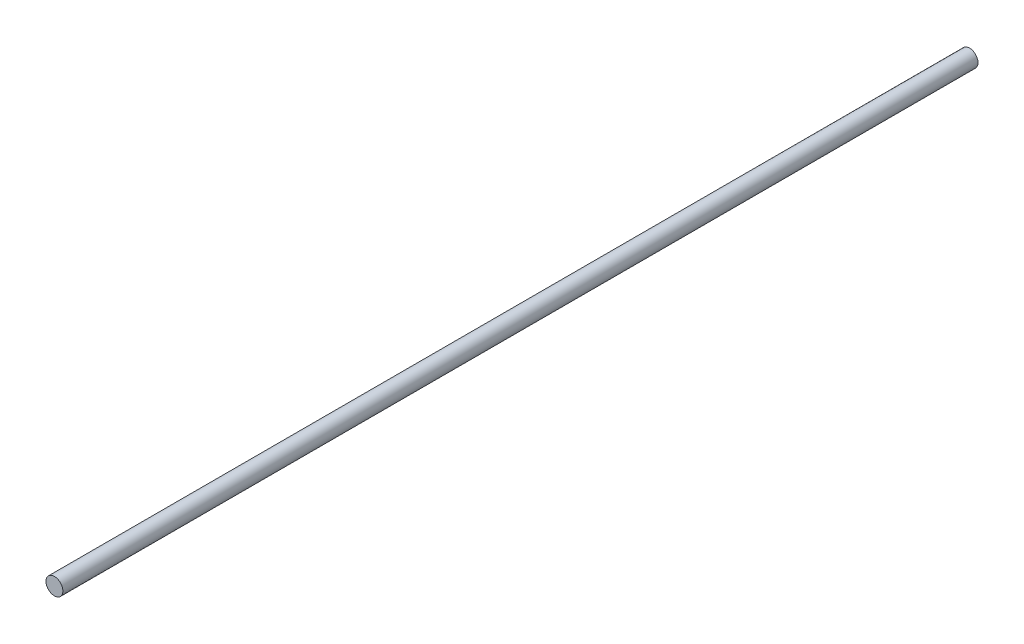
from build123d import *

# Parameters (mm, degrees)
SKETCH1_R           = 30
BOSS_EXTRUDE1_DEPTH = 3250


with BuildPart() as part:
    # Sketch1 → Boss-Extrude1 (new body)
    with BuildSketch(Plane.XY):
        Circle(SKETCH1_R)
    extrude(amount=-BOSS_EXTRUDE1_DEPTH)


solid = part.part
